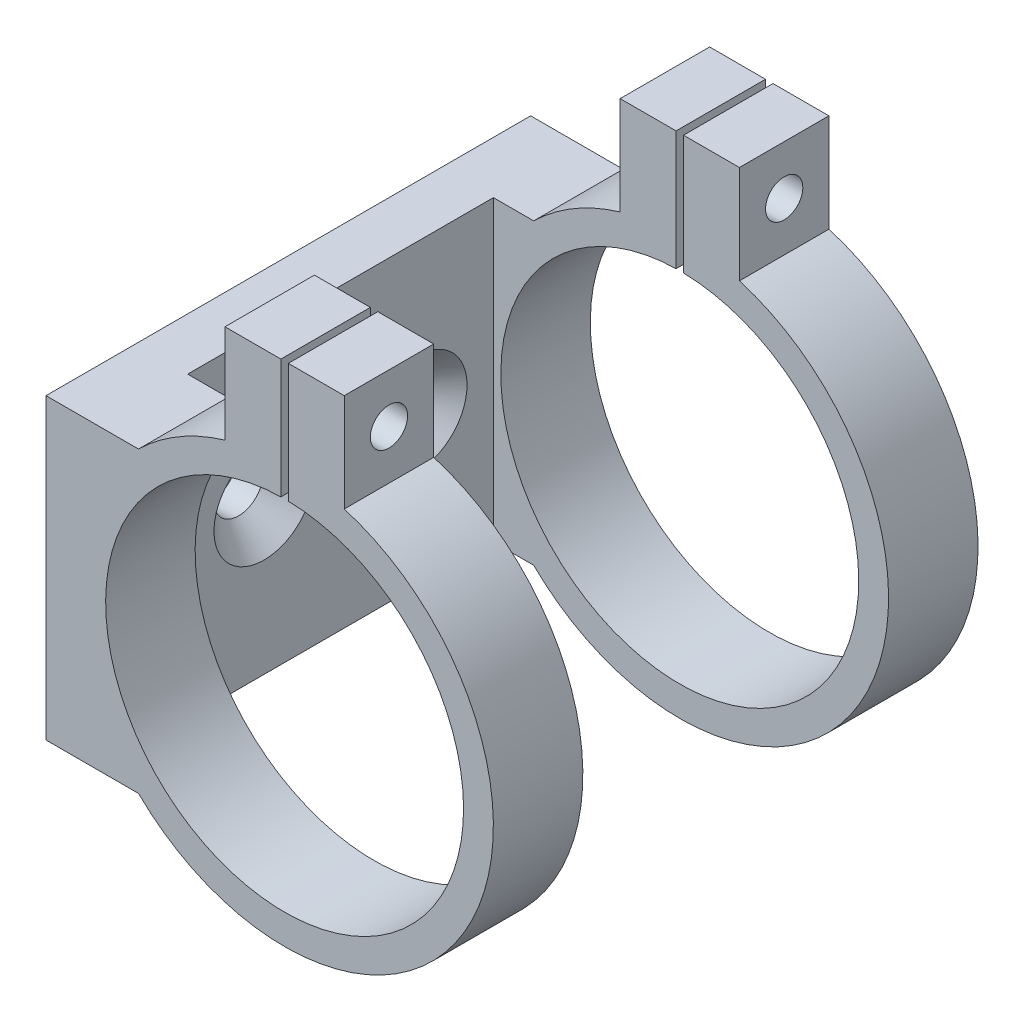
ISO-10303-21;
HEADER;
FILE_DESCRIPTION(('STEP AP214'),'2;1');
FILE_NAME('part.step','',(''),(''),'','','');
FILE_SCHEMA(('AUTOMOTIVE_DESIGN { 1 0 10303 214 1 1 1 1 }'));
ENDSEC;
DATA;
#1=APPLICATION_CONTEXT('core data for automotive mechanical design processes');
#2=APPLICATION_PROTOCOL_DEFINITION('international standard','automotive_design',2000,#1);
#3=PRODUCT_CONTEXT('',#1,'mechanical');
#4=PRODUCT('Part','Part','',(#3));
#5=PRODUCT_RELATED_PRODUCT_CATEGORY('part','',(#4));
#6=PRODUCT_DEFINITION_FORMATION('','',#4);
#7=PRODUCT_DEFINITION_CONTEXT('part definition',#1,'design');
#8=PRODUCT_DEFINITION('design','',#6,#7);
#9=PRODUCT_DEFINITION_SHAPE('','',#8);
#10=(LENGTH_UNIT() NAMED_UNIT(*) SI_UNIT(.MILLI.,.METRE.));
#11=(NAMED_UNIT(*) PLANE_ANGLE_UNIT() SI_UNIT($,.RADIAN.));
#12=(NAMED_UNIT(*) SI_UNIT($,.STERADIAN.) SOLID_ANGLE_UNIT());
#13=UNCERTAINTY_MEASURE_WITH_UNIT(LENGTH_MEASURE(1.E-05),#10,'distance_accuracy_value','');
#14=(GEOMETRIC_REPRESENTATION_CONTEXT(3) GLOBAL_UNCERTAINTY_ASSIGNED_CONTEXT((#13)) GLOBAL_UNIT_ASSIGNED_CONTEXT((#10,
#11,#12)) REPRESENTATION_CONTEXT('',''));
#15=CARTESIAN_POINT('',(0.,0.,0.));
#16=DIRECTION('',(0.,0.,1.));
#17=DIRECTION('',(1.,0.,0.));
#18=AXIS2_PLACEMENT_3D('',#15,#16,#17);
#19=CARTESIAN_POINT('',(0.,40.,32.5));
#20=DIRECTION('',(0.,-1.,0.));
#21=DIRECTION('',(0.,0.,-1.));
#22=AXIS2_PLACEMENT_3D('',#19,#20,#21);
#23=PLANE('',#22);
#24=DIRECTION('',(-1.,0.,0.));
#25=VECTOR('',#24,1.);
#26=CARTESIAN_POINT('',(28.,40.,20.5));
#27=LINE('',#26,#25);
#28=CARTESIAN_POINT('',(8.,40.,20.5));
#29=VERTEX_POINT('',#28);
#30=CARTESIAN_POINT('',(0.5,40.,20.5));
#31=VERTEX_POINT('',#30);
#32=EDGE_CURVE('E295',#29,#31,#27,.T.);
#33=ORIENTED_EDGE('',*,*,#32,.T.);
#34=DIRECTION('',(0.,0.,1.));
#35=VECTOR('',#34,1.);
#36=CARTESIAN_POINT('',(0.500000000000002,40.,32.5));
#37=LINE('',#36,#35);
#38=CARTESIAN_POINT('',(0.500000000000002,40.,32.5));
#39=VERTEX_POINT('',#38);
#40=EDGE_CURVE('E65',#31,#39,#37,.T.);
#41=ORIENTED_EDGE('',*,*,#40,.T.);
#42=DIRECTION('',(-1.,0.,0.));
#43=VECTOR('',#42,1.);
#44=CARTESIAN_POINT('',(0.,40.,32.5));
#45=LINE('',#44,#43);
#46=CARTESIAN_POINT('',(8.,40.,32.5));
#47=VERTEX_POINT('',#46);
#48=EDGE_CURVE('E455',#47,#39,#45,.T.);
#49=ORIENTED_EDGE('',*,*,#48,.F.);
#50=DIRECTION('',(0.,0.,-1.));
#51=VECTOR('',#50,1.);
#52=CARTESIAN_POINT('',(8.,40.,32.5));
#53=LINE('',#52,#51);
#54=EDGE_CURVE('E260',#47,#29,#53,.T.);
#55=ORIENTED_EDGE('',*,*,#54,.T.);
#56=EDGE_LOOP('',(#33,#41,#49,#55));
#57=FACE_BOUND('',#56,.T.);
#58=ADVANCED_FACE('F47',(#57),#23,.F.);
#59=DIRECTION('',(-1.,0.,0.));
#60=VECTOR('',#59,1.);
#61=CARTESIAN_POINT('',(0.,40.,-32.5));
#62=LINE('',#61,#60);
#63=CARTESIAN_POINT('',(8.,40.,-32.5));
#64=VERTEX_POINT('',#63);
#65=CARTESIAN_POINT('',(0.500000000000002,40.,-32.5));
#66=VERTEX_POINT('',#65);
#67=EDGE_CURVE('E240',#64,#66,#62,.T.);
#68=ORIENTED_EDGE('',*,*,#67,.T.);
#69=DIRECTION('',(0.,0.,1.));
#70=VECTOR('',#69,1.);
#71=CARTESIAN_POINT('',(0.500000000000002,40.,32.5));
#72=LINE('',#71,#70);
#73=CARTESIAN_POINT('',(0.5,40.,-20.5));
#74=VERTEX_POINT('',#73);
#75=EDGE_CURVE('E364',#66,#74,#72,.T.);
#76=ORIENTED_EDGE('',*,*,#75,.T.);
#77=DIRECTION('',(-1.,0.,0.));
#78=VECTOR('',#77,1.);
#79=CARTESIAN_POINT('',(28.,40.,-20.5));
#80=LINE('',#79,#78);
#81=CARTESIAN_POINT('',(8.,40.,-20.5));
#82=VERTEX_POINT('',#81);
#83=EDGE_CURVE('E388',#82,#74,#80,.T.);
#84=ORIENTED_EDGE('',*,*,#83,.F.);
#85=EDGE_CURVE('E258',#82,#64,#53,.T.);
#86=ORIENTED_EDGE('',*,*,#85,.T.);
#87=EDGE_LOOP('',(#68,#76,#84,#86));
#88=FACE_BOUND('',#87,.T.);
#89=ADVANCED_FACE('F700',(#88),#23,.F.);
#90=CARTESIAN_POINT('',(-8.,0.,32.5));
#91=DIRECTION('',(1.,0.,0.));
#92=DIRECTION('',(0.,0.,-1.));
#93=AXIS2_PLACEMENT_3D('',#90,#91,#92);
#94=PLANE('',#93);
#95=CARTESIAN_POINT('',(-8.,33.4164078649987,26.5));
#96=DIRECTION('',(1.,0.,0.));
#97=DIRECTION('',(0.,0.,-1.));
#98=AXIS2_PLACEMENT_3D('',#95,#96,#97);
#99=CIRCLE('',#98,2.5);
#100=CARTESIAN_POINT('',(-8.,33.4164078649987,24.));
#101=VERTEX_POINT('',#100);
#102=EDGE_CURVE('E328',#101,#101,#99,.F.);
#103=ORIENTED_EDGE('',*,*,#102,.F.);
#104=EDGE_LOOP('',(#103));
#105=FACE_BOUND('',#104,.T.);
#106=DIRECTION('',(0.,0.,-1.));
#107=VECTOR('',#106,1.);
#108=CARTESIAN_POINT('',(-8.,40.,32.5));
#109=LINE('',#108,#107);
#110=CARTESIAN_POINT('',(-8.,40.,32.5));
#111=VERTEX_POINT('',#110);
#112=CARTESIAN_POINT('',(-8.,40.,20.5));
#113=VERTEX_POINT('',#112);
#114=EDGE_CURVE('E254',#111,#113,#109,.T.);
#115=ORIENTED_EDGE('',*,*,#114,.T.);
#116=DIRECTION('',(0.,-1.,0.));
#117=VECTOR('',#116,1.);
#118=CARTESIAN_POINT('',(-8.,0.,20.5));
#119=LINE('',#118,#117);
#120=CARTESIAN_POINT('',(-8.,26.8328157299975,20.5));
#121=VERTEX_POINT('',#120);
#122=EDGE_CURVE('E428',#113,#121,#119,.T.);
#123=ORIENTED_EDGE('',*,*,#122,.T.);
#124=DIRECTION('',(0.,0.,-1.));
#125=VECTOR('',#124,1.);
#126=CARTESIAN_POINT('',(-8.,26.8328157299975,32.5));
#127=LINE('',#126,#125);
#128=CARTESIAN_POINT('',(-8.,26.8328157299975,32.5));
#129=VERTEX_POINT('',#128);
#130=EDGE_CURVE('E286',#129,#121,#127,.T.);
#131=ORIENTED_EDGE('',*,*,#130,.F.);
#132=DIRECTION('',(0.,-1.,0.));
#133=VECTOR('',#132,1.);
#134=CARTESIAN_POINT('',(-8.,0.,32.5));
#135=LINE('',#134,#133);
#136=EDGE_CURVE('E239',#111,#129,#135,.T.);
#137=ORIENTED_EDGE('',*,*,#136,.F.);
#138=EDGE_LOOP('',(#115,#123,#131,#137));
#139=FACE_BOUND('',#138,.T.);
#140=ADVANCED_FACE('F646',(#105,#139),#94,.F.);
#141=CARTESIAN_POINT('',(0.,0.,32.5));
#142=DIRECTION('',(0.,0.,-1.));
#143=DIRECTION('',(-1.,0.,0.));
#144=AXIS2_PLACEMENT_3D('',#141,#142,#143);
#145=CYLINDRICAL_SURFACE('',#144,28.);
#146=ORIENTED_EDGE('',*,*,#130,.T.);
#147=CARTESIAN_POINT('',(0.,0.,20.5));
#148=DIRECTION('',(0.,0.,1.));
#149=DIRECTION('',(0.,-1.,0.));
#150=AXIS2_PLACEMENT_3D('',#147,#148,#149);
#151=CIRCLE('',#150,28.);
#152=CARTESIAN_POINT('',(-19.5959179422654,20.,20.5));
#153=VERTEX_POINT('',#152);
#154=EDGE_CURVE('E424',#121,#153,#151,.T.);
#155=ORIENTED_EDGE('',*,*,#154,.T.);
#156=DIRECTION('',(0.,0.,-1.));
#157=VECTOR('',#156,1.);
#158=CARTESIAN_POINT('',(-19.5959179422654,20.,32.5));
#159=LINE('',#158,#157);
#160=CARTESIAN_POINT('',(-19.5959179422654,20.,32.5));
#161=VERTEX_POINT('',#160);
#162=EDGE_CURVE('E281',#161,#153,#159,.T.);
#163=ORIENTED_EDGE('',*,*,#162,.F.);
#164=CARTESIAN_POINT('',(0.,0.,32.5));
#165=DIRECTION('',(0.,0.,1.));
#166=DIRECTION('',(1.,0.,0.));
#167=AXIS2_PLACEMENT_3D('',#164,#165,#166);
#168=CIRCLE('',#167,28.);
#169=EDGE_CURVE('E247',#129,#161,#168,.T.);
#170=ORIENTED_EDGE('',*,*,#169,.F.);
#171=EDGE_LOOP('',(#146,#155,#163,#170));
#172=FACE_BOUND('',#171,.T.);
#173=ADVANCED_FACE('F641',(#172),#145,.T.);
#174=CARTESIAN_POINT('',(0.,0.,20.5));
#175=DIRECTION('',(0.,0.,1.));
#176=DIRECTION('',(0.,-1.,0.));
#177=AXIS2_PLACEMENT_3D('',#174,#175,#176);
#178=CIRCLE('',#177,28.);
#179=CARTESIAN_POINT('',(-19.5959179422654,-20.,20.5));
#180=VERTEX_POINT('',#179);
#181=CARTESIAN_POINT('',(8.,26.8328157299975,20.5));
#182=VERTEX_POINT('',#181);
#183=EDGE_CURVE('E414',#180,#182,#178,.T.);
#184=ORIENTED_EDGE('',*,*,#183,.T.);
#185=DIRECTION('',(0.,0.,-1.));
#186=VECTOR('',#185,1.);
#187=CARTESIAN_POINT('',(8.,26.8328157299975,32.5));
#188=LINE('',#187,#186);
#189=CARTESIAN_POINT('',(8.,26.8328157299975,32.5));
#190=VERTEX_POINT('',#189);
#191=EDGE_CURVE('E265',#190,#182,#188,.T.);
#192=ORIENTED_EDGE('',*,*,#191,.F.);
#193=CARTESIAN_POINT('',(-19.5959179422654,-20.,32.5));
#194=VERTEX_POINT('',#193);
#195=EDGE_CURVE('E439',#194,#190,#168,.T.);
#196=ORIENTED_EDGE('',*,*,#195,.F.);
#197=DIRECTION('',(0.,0.,-1.));
#198=VECTOR('',#197,1.);
#199=CARTESIAN_POINT('',(-19.5959179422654,-20.,32.5));
#200=LINE('',#199,#198);
#201=EDGE_CURVE('E270',#194,#180,#200,.T.);
#202=ORIENTED_EDGE('',*,*,#201,.T.);
#203=EDGE_LOOP('',(#184,#192,#196,#202));
#204=FACE_BOUND('',#203,.T.);
#205=ADVANCED_FACE('F671',(#204),#145,.T.);
#206=CARTESIAN_POINT('',(8.,0.,32.5));
#207=DIRECTION('',(1.,0.,0.));
#208=DIRECTION('',(0.,0.,-1.));
#209=AXIS2_PLACEMENT_3D('',#206,#207,#208);
#210=PLANE('',#209);
#211=CARTESIAN_POINT('',(8.,33.4164078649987,26.5));
#212=DIRECTION('',(1.,0.,0.));
#213=DIRECTION('',(0.,0.,-1.));
#214=AXIS2_PLACEMENT_3D('',#211,#212,#213);
#215=CIRCLE('',#214,2.5);
#216=CARTESIAN_POINT('',(8.,33.4164078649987,24.));
#217=VERTEX_POINT('',#216);
#218=EDGE_CURVE('E332',#217,#217,#215,.T.);
#219=ORIENTED_EDGE('',*,*,#218,.F.);
#220=EDGE_LOOP('',(#219));
#221=FACE_BOUND('',#220,.T.);
#222=DIRECTION('',(0.,-1.,0.));
#223=VECTOR('',#222,1.);
#224=CARTESIAN_POINT('',(8.,0.,20.5));
#225=LINE('',#224,#223);
#226=EDGE_CURVE('E300',#29,#182,#225,.T.);
#227=ORIENTED_EDGE('',*,*,#226,.F.);
#228=ORIENTED_EDGE('',*,*,#54,.F.);
#229=DIRECTION('',(0.,-1.,0.));
#230=VECTOR('',#229,1.);
#231=CARTESIAN_POINT('',(8.,0.,32.5));
#232=LINE('',#231,#230);
#233=EDGE_CURVE('E450',#47,#190,#232,.T.);
#234=ORIENTED_EDGE('',*,*,#233,.T.);
#235=ORIENTED_EDGE('',*,*,#191,.T.);
#236=EDGE_LOOP('',(#227,#228,#234,#235));
#237=FACE_BOUND('',#236,.T.);
#238=ADVANCED_FACE('F667',(#221,#237),#210,.T.);
#239=CARTESIAN_POINT('',(-0.499999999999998,40.,32.5));
#240=VERTEX_POINT('',#239);
#241=EDGE_CURVE('E454',#240,#111,#45,.T.);
#242=ORIENTED_EDGE('',*,*,#241,.F.);
#243=DIRECTION('',(0.,0.,-1.));
#244=VECTOR('',#243,1.);
#245=CARTESIAN_POINT('',(-0.499999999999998,40.,32.5));
#246=LINE('',#245,#244);
#247=CARTESIAN_POINT('',(-0.499999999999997,40.,20.5));
#248=VERTEX_POINT('',#247);
#249=EDGE_CURVE('E358',#240,#248,#246,.T.);
#250=ORIENTED_EDGE('',*,*,#249,.T.);
#251=EDGE_CURVE('E387',#248,#113,#27,.T.);
#252=ORIENTED_EDGE('',*,*,#251,.T.);
#253=ORIENTED_EDGE('',*,*,#114,.F.);
#254=EDGE_LOOP('',(#242,#250,#252,#253));
#255=FACE_BOUND('',#254,.T.);
#256=ADVANCED_FACE('F651',(#255),#23,.F.);
#257=CARTESIAN_POINT('',(0.,0.,32.5));
#258=DIRECTION('',(0.,0.,-1.));
#259=DIRECTION('',(-1.,0.,0.));
#260=AXIS2_PLACEMENT_3D('',#257,#258,#259);
#261=CYLINDRICAL_SURFACE('',#260,24.);
#262=DIRECTION('',(0.,0.,-1.));
#263=VECTOR('',#262,1.);
#264=CARTESIAN_POINT('',(0.500000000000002,23.9947911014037,32.5));
#265=LINE('',#264,#263);
#266=CARTESIAN_POINT('',(0.5,23.9947911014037,20.5));
#267=VERTEX_POINT('',#266);
#268=CARTESIAN_POINT('',(0.500000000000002,23.9947911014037,32.5));
#269=VERTEX_POINT('',#268);
#270=EDGE_CURVE('E371',#267,#269,#265,.F.);
#271=ORIENTED_EDGE('',*,*,#270,.F.);
#272=CARTESIAN_POINT('',(0.,0.,20.5));
#273=DIRECTION('',(0.,0.,1.));
#274=DIRECTION('',(0.,-1.,0.));
#275=AXIS2_PLACEMENT_3D('',#272,#273,#274);
#276=CIRCLE('',#275,24.);
#277=CARTESIAN_POINT('',(-0.499999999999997,23.9947911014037,20.5));
#278=VERTEX_POINT('',#277);
#279=EDGE_CURVE('E296',#278,#267,#276,.T.);
#280=ORIENTED_EDGE('',*,*,#279,.F.);
#281=DIRECTION('',(0.,0.,-1.));
#282=VECTOR('',#281,1.);
#283=CARTESIAN_POINT('',(-0.499999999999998,23.9947911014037,32.5));
#284=LINE('',#283,#282);
#285=CARTESIAN_POINT('',(-0.499999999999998,23.9947911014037,32.5));
#286=VERTEX_POINT('',#285);
#287=EDGE_CURVE('E73',#286,#278,#284,.T.);
#288=ORIENTED_EDGE('',*,*,#287,.F.);
#289=CARTESIAN_POINT('',(0.,0.,32.5));
#290=DIRECTION('',(0.,0.,1.));
#291=DIRECTION('',(1.,0.,0.));
#292=AXIS2_PLACEMENT_3D('',#289,#290,#291);
#293=CIRCLE('',#292,24.);
#294=EDGE_CURVE('E459',#286,#269,#293,.T.);
#295=ORIENTED_EDGE('',*,*,#294,.T.);
#296=EDGE_LOOP('',(#271,#280,#288,#295));
#297=FACE_BOUND('',#296,.T.);
#298=ADVANCED_FACE('F655',(#297),#261,.F.);
#299=CARTESIAN_POINT('',(-8.,33.4164078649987,-26.5));
#300=DIRECTION('',(1.,0.,0.));
#301=DIRECTION('',(0.,0.,-1.));
#302=AXIS2_PLACEMENT_3D('',#299,#300,#301);
#303=CIRCLE('',#302,2.5);
#304=CARTESIAN_POINT('',(-8.,33.4164078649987,-29.));
#305=VERTEX_POINT('',#304);
#306=EDGE_CURVE('E310',#305,#305,#303,.F.);
#307=ORIENTED_EDGE('',*,*,#306,.F.);
#308=EDGE_LOOP('',(#307));
#309=FACE_BOUND('',#308,.T.);
#310=CARTESIAN_POINT('',(-8.,26.8328157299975,-20.5));
#311=VERTEX_POINT('',#310);
#312=CARTESIAN_POINT('',(-8.,26.8328157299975,-32.5));
#313=VERTEX_POINT('',#312);
#314=EDGE_CURVE('E285',#311,#313,#127,.T.);
#315=ORIENTED_EDGE('',*,*,#314,.F.);
#316=DIRECTION('',(0.,1.,0.));
#317=VECTOR('',#316,1.);
#318=CARTESIAN_POINT('',(-8.,0.,-20.5));
#319=LINE('',#318,#317);
#320=CARTESIAN_POINT('',(-8.,40.,-20.5));
#321=VERTEX_POINT('',#320);
#322=EDGE_CURVE('E301',#311,#321,#319,.T.);
#323=ORIENTED_EDGE('',*,*,#322,.T.);
#324=CARTESIAN_POINT('',(-8.,40.,-32.5));
#325=VERTEX_POINT('',#324);
#326=EDGE_CURVE('E259',#321,#325,#109,.T.);
#327=ORIENTED_EDGE('',*,*,#326,.T.);
#328=DIRECTION('',(0.,-1.,0.));
#329=VECTOR('',#328,1.);
#330=CARTESIAN_POINT('',(-8.,0.,-32.5));
#331=LINE('',#330,#329);
#332=EDGE_CURVE('E434',#325,#313,#331,.T.);
#333=ORIENTED_EDGE('',*,*,#332,.T.);
#334=EDGE_LOOP('',(#315,#323,#327,#333));
#335=FACE_BOUND('',#334,.T.);
#336=ADVANCED_FACE('F49',(#309,#335),#94,.F.);
#337=CARTESIAN_POINT('',(-19.5959179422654,20.,-20.5));
#338=VERTEX_POINT('',#337);
#339=CARTESIAN_POINT('',(-19.5959179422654,20.,-32.5));
#340=VERTEX_POINT('',#339);
#341=EDGE_CURVE('E280',#338,#340,#159,.T.);
#342=ORIENTED_EDGE('',*,*,#341,.F.);
#343=CARTESIAN_POINT('',(0.,0.,-20.5));
#344=DIRECTION('',(0.,0.,-1.));
#345=DIRECTION('',(-1.,0.,0.));
#346=AXIS2_PLACEMENT_3D('',#343,#344,#345);
#347=CIRCLE('',#346,28.);
#348=EDGE_CURVE('E404',#338,#311,#347,.T.);
#349=ORIENTED_EDGE('',*,*,#348,.T.);
#350=ORIENTED_EDGE('',*,*,#314,.T.);
#351=CARTESIAN_POINT('',(0.,0.,-32.5));
#352=DIRECTION('',(0.,0.,1.));
#353=DIRECTION('',(1.,0.,0.));
#354=AXIS2_PLACEMENT_3D('',#351,#352,#353);
#355=CIRCLE('',#354,28.);
#356=EDGE_CURVE('E466',#313,#340,#355,.T.);
#357=ORIENTED_EDGE('',*,*,#356,.T.);
#358=EDGE_LOOP('',(#342,#349,#350,#357));
#359=FACE_BOUND('',#358,.T.);
#360=ADVANCED_FACE('F677',(#359),#145,.T.);
#361=CARTESIAN_POINT('',(0.,20.,32.5));
#362=DIRECTION('',(0.,1.,0.));
#363=DIRECTION('',(0.,0.,1.));
#364=AXIS2_PLACEMENT_3D('',#361,#362,#363);
#365=PLANE('',#364);
#366=DIRECTION('',(1.,0.,0.));
#367=VECTOR('',#366,1.);
#368=CARTESIAN_POINT('',(0.,20.,20.5));
#369=LINE('',#368,#367);
#370=CARTESIAN_POINT('',(-25.,20.,20.5));
#371=VERTEX_POINT('',#370);
#372=EDGE_CURVE('E421',#371,#153,#369,.T.);
#373=ORIENTED_EDGE('',*,*,#372,.F.);
#374=DIRECTION('',(0.,0.,1.));
#375=VECTOR('',#374,1.);
#376=CARTESIAN_POINT('',(-25.,20.,32.5));
#377=LINE('',#376,#375);
#378=CARTESIAN_POINT('',(-25.,20.,-20.5));
#379=VERTEX_POINT('',#378);
#380=EDGE_CURVE('E432',#379,#371,#377,.T.);
#381=ORIENTED_EDGE('',*,*,#380,.F.);
#382=DIRECTION('',(-1.,0.,0.));
#383=VECTOR('',#382,1.);
#384=CARTESIAN_POINT('',(0.,20.,-20.5));
#385=LINE('',#384,#383);
#386=EDGE_CURVE('E401',#338,#379,#385,.T.);
#387=ORIENTED_EDGE('',*,*,#386,.F.);
#388=ORIENTED_EDGE('',*,*,#341,.T.);
#389=DIRECTION('',(1.,0.,0.));
#390=VECTOR('',#389,1.);
#391=CARTESIAN_POINT('',(0.,20.,-32.5));
#392=LINE('',#391,#390);
#393=CARTESIAN_POINT('',(-32.,20.,-32.5));
#394=VERTEX_POINT('',#393);
#395=EDGE_CURVE('E470',#394,#340,#392,.T.);
#396=ORIENTED_EDGE('',*,*,#395,.F.);
#397=DIRECTION('',(0.,0.,-1.));
#398=VECTOR('',#397,1.);
#399=CARTESIAN_POINT('',(-32.,20.,32.5));
#400=LINE('',#399,#398);
#401=CARTESIAN_POINT('',(-32.,20.,32.5));
#402=VERTEX_POINT('',#401);
#403=EDGE_CURVE('E277',#402,#394,#400,.T.);
#404=ORIENTED_EDGE('',*,*,#403,.F.);
#405=DIRECTION('',(1.,0.,0.));
#406=VECTOR('',#405,1.);
#407=CARTESIAN_POINT('',(0.,20.,32.5));
#408=LINE('',#407,#406);
#409=EDGE_CURVE('E438',#402,#161,#408,.T.);
#410=ORIENTED_EDGE('',*,*,#409,.T.);
#411=ORIENTED_EDGE('',*,*,#162,.T.);
#412=EDGE_LOOP('',(#373,#381,#387,#388,#396,#404,#410,#411));
#413=FACE_BOUND('',#412,.T.);
#414=ADVANCED_FACE('F507',(#413),#365,.T.);
#415=CARTESIAN_POINT('',(-32.,0.,32.5));
#416=DIRECTION('',(-1.,0.,0.));
#417=DIRECTION('',(0.,-1.,0.));
#418=AXIS2_PLACEMENT_3D('',#415,#416,#417);
#419=PLANE('',#418);
#420=CARTESIAN_POINT('',(-32.,0.,10.25));
#421=DIRECTION('',(1.,0.,0.));
#422=DIRECTION('',(0.,0.,-1.));
#423=AXIS2_PLACEMENT_3D('',#420,#421,#422);
#424=CIRCLE('',#423,3.3);
#425=CARTESIAN_POINT('',(-32.,0.,6.95));
#426=VERTEX_POINT('',#425);
#427=EDGE_CURVE('E618',#426,#426,#424,.T.);
#428=ORIENTED_EDGE('',*,*,#427,.T.);
#429=EDGE_LOOP('',(#428));
#430=FACE_BOUND('',#429,.T.);
#431=CARTESIAN_POINT('',(-32.,0.,-10.25));
#432=DIRECTION('',(1.,0.,0.));
#433=DIRECTION('',(0.,0.,-1.));
#434=AXIS2_PLACEMENT_3D('',#431,#432,#433);
#435=CIRCLE('',#434,3.3);
#436=CARTESIAN_POINT('',(-32.,0.,-13.55));
#437=VERTEX_POINT('',#436);
#438=EDGE_CURVE('E336',#437,#437,#435,.T.);
#439=ORIENTED_EDGE('',*,*,#438,.T.);
#440=EDGE_LOOP('',(#439));
#441=FACE_BOUND('',#440,.T.);
#442=DIRECTION('',(0.,1.,0.));
#443=VECTOR('',#442,1.);
#444=CARTESIAN_POINT('',(-32.,0.,-32.5));
#445=LINE('',#444,#443);
#446=CARTESIAN_POINT('',(-32.,-20.,-32.5));
#447=VERTEX_POINT('',#446);
#448=EDGE_CURVE('E475',#447,#394,#445,.T.);
#449=ORIENTED_EDGE('',*,*,#448,.F.);
#450=DIRECTION('',(0.,0.,-1.));
#451=VECTOR('',#450,1.);
#452=CARTESIAN_POINT('',(-32.,-20.,32.5));
#453=LINE('',#452,#451);
#454=CARTESIAN_POINT('',(-32.,-20.,32.5));
#455=VERTEX_POINT('',#454);
#456=EDGE_CURVE('E274',#455,#447,#453,.T.);
#457=ORIENTED_EDGE('',*,*,#456,.F.);
#458=DIRECTION('',(0.,1.,0.));
#459=VECTOR('',#458,1.);
#460=CARTESIAN_POINT('',(-32.,0.,32.5));
#461=LINE('',#460,#459);
#462=EDGE_CURVE('E443',#455,#402,#461,.T.);
#463=ORIENTED_EDGE('',*,*,#462,.T.);
#464=ORIENTED_EDGE('',*,*,#403,.T.);
#465=EDGE_LOOP('',(#449,#457,#463,#464));
#466=FACE_BOUND('',#465,.T.);
#467=ADVANCED_FACE('F500',(#430,#441,#466),#419,.T.);
#468=CARTESIAN_POINT('',(0.,-20.,32.5));
#469=DIRECTION('',(0.,1.,0.));
#470=DIRECTION('',(0.,0.,1.));
#471=AXIS2_PLACEMENT_3D('',#468,#469,#470);
#472=PLANE('',#471);
#473=DIRECTION('',(0.,0.,1.));
#474=VECTOR('',#473,1.);
#475=CARTESIAN_POINT('',(-25.,-20.,32.5));
#476=LINE('',#475,#474);
#477=CARTESIAN_POINT('',(-25.,-20.,-20.5));
#478=VERTEX_POINT('',#477);
#479=CARTESIAN_POINT('',(-25.,-20.,20.5));
#480=VERTEX_POINT('',#479);
#481=EDGE_CURVE('E290',#478,#480,#476,.T.);
#482=ORIENTED_EDGE('',*,*,#481,.T.);
#483=DIRECTION('',(1.,0.,0.));
#484=VECTOR('',#483,1.);
#485=CARTESIAN_POINT('',(0.,-20.,20.5));
#486=LINE('',#485,#484);
#487=EDGE_CURVE('E417',#480,#180,#486,.T.);
#488=ORIENTED_EDGE('',*,*,#487,.T.);
#489=ORIENTED_EDGE('',*,*,#201,.F.);
#490=DIRECTION('',(1.,0.,0.));
#491=VECTOR('',#490,1.);
#492=CARTESIAN_POINT('',(0.,-20.,32.5));
#493=LINE('',#492,#491);
#494=EDGE_CURVE('E447',#455,#194,#493,.T.);
#495=ORIENTED_EDGE('',*,*,#494,.F.);
#496=ORIENTED_EDGE('',*,*,#456,.T.);
#497=DIRECTION('',(1.,0.,0.));
#498=VECTOR('',#497,1.);
#499=CARTESIAN_POINT('',(0.,-20.,-32.5));
#500=LINE('',#499,#498);
#501=CARTESIAN_POINT('',(-19.5959179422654,-20.,-32.5));
#502=VERTEX_POINT('',#501);
#503=EDGE_CURVE('E478',#447,#502,#500,.T.);
#504=ORIENTED_EDGE('',*,*,#503,.T.);
#505=CARTESIAN_POINT('',(-19.5959179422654,-20.,-20.5));
#506=VERTEX_POINT('',#505);
#507=EDGE_CURVE('E269',#506,#502,#200,.T.);
#508=ORIENTED_EDGE('',*,*,#507,.F.);
#509=DIRECTION('',(-1.,0.,0.));
#510=VECTOR('',#509,1.);
#511=CARTESIAN_POINT('',(0.,-20.,-20.5));
#512=LINE('',#511,#510);
#513=EDGE_CURVE('E397',#506,#478,#512,.T.);
#514=ORIENTED_EDGE('',*,*,#513,.T.);
#515=EDGE_LOOP('',(#482,#488,#489,#495,#496,#504,#508,#514));
#516=FACE_BOUND('',#515,.T.);
#517=ADVANCED_FACE('F673',(#516),#472,.F.);
#518=CARTESIAN_POINT('',(8.,26.8328157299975,-20.5));
#519=VERTEX_POINT('',#518);
#520=CARTESIAN_POINT('',(8.,26.8328157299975,-32.5));
#521=VERTEX_POINT('',#520);
#522=EDGE_CURVE('E264',#519,#521,#188,.T.);
#523=ORIENTED_EDGE('',*,*,#522,.F.);
#524=CARTESIAN_POINT('',(0.,0.,-20.5));
#525=DIRECTION('',(0.,0.,-1.));
#526=DIRECTION('',(-1.,0.,0.));
#527=AXIS2_PLACEMENT_3D('',#524,#525,#526);
#528=CIRCLE('',#527,28.);
#529=EDGE_CURVE('E394',#519,#506,#528,.T.);
#530=ORIENTED_EDGE('',*,*,#529,.T.);
#531=ORIENTED_EDGE('',*,*,#507,.T.);
#532=EDGE_CURVE('E471',#502,#521,#355,.T.);
#533=ORIENTED_EDGE('',*,*,#532,.T.);
#534=EDGE_LOOP('',(#523,#530,#531,#533));
#535=FACE_BOUND('',#534,.T.);
#536=ADVANCED_FACE('F494',(#535),#145,.T.);
#537=CARTESIAN_POINT('',(8.,33.4164078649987,-26.5));
#538=DIRECTION('',(1.,0.,0.));
#539=DIRECTION('',(0.,0.,-1.));
#540=AXIS2_PLACEMENT_3D('',#537,#538,#539);
#541=CIRCLE('',#540,2.5);
#542=CARTESIAN_POINT('',(8.,33.4164078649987,-29.));
#543=VERTEX_POINT('',#542);
#544=EDGE_CURVE('E321',#543,#543,#541,.T.);
#545=ORIENTED_EDGE('',*,*,#544,.F.);
#546=EDGE_LOOP('',(#545));
#547=FACE_BOUND('',#546,.T.);
#548=DIRECTION('',(0.,1.,0.));
#549=VECTOR('',#548,1.);
#550=CARTESIAN_POINT('',(8.,0.,-20.5));
#551=LINE('',#550,#549);
#552=EDGE_CURVE('E294',#519,#82,#551,.T.);
#553=ORIENTED_EDGE('',*,*,#552,.F.);
#554=ORIENTED_EDGE('',*,*,#522,.T.);
#555=DIRECTION('',(0.,-1.,0.));
#556=VECTOR('',#555,1.);
#557=CARTESIAN_POINT('',(8.,0.,-32.5));
#558=LINE('',#557,#556);
#559=EDGE_CURVE('E481',#64,#521,#558,.T.);
#560=ORIENTED_EDGE('',*,*,#559,.F.);
#561=ORIENTED_EDGE('',*,*,#85,.F.);
#562=EDGE_LOOP('',(#553,#554,#560,#561));
#563=FACE_BOUND('',#562,.T.);
#564=ADVANCED_FACE('F710',(#547,#563),#210,.T.);
#565=CARTESIAN_POINT('',(-0.499999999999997,40.,-20.5));
#566=VERTEX_POINT('',#565);
#567=EDGE_CURVE('E383',#566,#321,#80,.T.);
#568=ORIENTED_EDGE('',*,*,#567,.F.);
#569=DIRECTION('',(0.,0.,-1.));
#570=VECTOR('',#569,1.);
#571=CARTESIAN_POINT('',(-0.499999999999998,40.,32.5));
#572=LINE('',#571,#570);
#573=CARTESIAN_POINT('',(-0.499999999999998,40.,-32.5));
#574=VERTEX_POINT('',#573);
#575=EDGE_CURVE('E221',#566,#574,#572,.T.);
#576=ORIENTED_EDGE('',*,*,#575,.T.);
#577=EDGE_CURVE('E231',#574,#325,#62,.T.);
#578=ORIENTED_EDGE('',*,*,#577,.T.);
#579=ORIENTED_EDGE('',*,*,#326,.F.);
#580=EDGE_LOOP('',(#568,#576,#578,#579));
#581=FACE_BOUND('',#580,.T.);
#582=ADVANCED_FACE('F702',(#581),#23,.F.);
#583=DIRECTION('',(0.,0.,-1.));
#584=VECTOR('',#583,1.);
#585=CARTESIAN_POINT('',(0.500000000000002,23.9947911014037,32.5));
#586=LINE('',#585,#584);
#587=CARTESIAN_POINT('',(0.500000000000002,23.9947911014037,-32.5));
#588=VERTEX_POINT('',#587);
#589=CARTESIAN_POINT('',(0.5,23.9947911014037,-20.5));
#590=VERTEX_POINT('',#589);
#591=EDGE_CURVE('E237',#588,#590,#586,.F.);
#592=ORIENTED_EDGE('',*,*,#591,.F.);
#593=CARTESIAN_POINT('',(0.,0.,-32.5));
#594=DIRECTION('',(0.,0.,1.));
#595=DIRECTION('',(1.,0.,0.));
#596=AXIS2_PLACEMENT_3D('',#593,#594,#595);
#597=CIRCLE('',#596,24.);
#598=CARTESIAN_POINT('',(-0.499999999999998,23.9947911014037,-32.5));
#599=VERTEX_POINT('',#598);
#600=EDGE_CURVE('E229',#599,#588,#597,.T.);
#601=ORIENTED_EDGE('',*,*,#600,.F.);
#602=DIRECTION('',(0.,0.,-1.));
#603=VECTOR('',#602,1.);
#604=CARTESIAN_POINT('',(-0.499999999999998,23.9947911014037,32.5));
#605=LINE('',#604,#603);
#606=CARTESIAN_POINT('',(-0.499999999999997,23.9947911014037,-20.5));
#607=VERTEX_POINT('',#606);
#608=EDGE_CURVE('E210',#607,#599,#605,.T.);
#609=ORIENTED_EDGE('',*,*,#608,.F.);
#610=CARTESIAN_POINT('',(0.,0.,-20.5));
#611=DIRECTION('',(0.,0.,-1.));
#612=DIRECTION('',(-1.,0.,0.));
#613=AXIS2_PLACEMENT_3D('',#610,#611,#612);
#614=CIRCLE('',#613,24.);
#615=EDGE_CURVE('E291',#590,#607,#614,.T.);
#616=ORIENTED_EDGE('',*,*,#615,.F.);
#617=EDGE_LOOP('',(#592,#601,#609,#616));
#618=FACE_BOUND('',#617,.T.);
#619=ADVANCED_FACE('F236',(#618),#261,.F.);
#620=CARTESIAN_POINT('',(0.,0.,32.5));
#621=DIRECTION('',(0.,0.,1.));
#622=DIRECTION('',(1.,0.,0.));
#623=AXIS2_PLACEMENT_3D('',#620,#621,#622);
#624=PLANE('',#623);
#625=DIRECTION('',(0.,1.,0.));
#626=VECTOR('',#625,1.);
#627=CARTESIAN_POINT('',(0.500000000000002,16.7683220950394,32.5));
#628=LINE('',#627,#626);
#629=EDGE_CURVE('E343',#269,#39,#628,.T.);
#630=ORIENTED_EDGE('',*,*,#629,.F.);
#631=ORIENTED_EDGE('',*,*,#294,.F.);
#632=DIRECTION('',(0.,-1.,0.));
#633=VECTOR('',#632,1.);
#634=CARTESIAN_POINT('',(-0.499999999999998,16.7683220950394,32.5));
#635=LINE('',#634,#633);
#636=EDGE_CURVE('E233',#240,#286,#635,.T.);
#637=ORIENTED_EDGE('',*,*,#636,.F.);
#638=ORIENTED_EDGE('',*,*,#241,.T.);
#639=ORIENTED_EDGE('',*,*,#136,.T.);
#640=ORIENTED_EDGE('',*,*,#169,.T.);
#641=ORIENTED_EDGE('',*,*,#409,.F.);
#642=ORIENTED_EDGE('',*,*,#462,.F.);
#643=ORIENTED_EDGE('',*,*,#494,.T.);
#644=ORIENTED_EDGE('',*,*,#195,.T.);
#645=ORIENTED_EDGE('',*,*,#233,.F.);
#646=ORIENTED_EDGE('',*,*,#48,.T.);
#647=EDGE_LOOP('',(#630,#631,#637,#638,#639,#640,#641,#642,#643,#644,#645,#646));
#648=FACE_BOUND('',#647,.T.);
#649=ADVANCED_FACE('F660',(#648),#624,.T.);
#650=CARTESIAN_POINT('',(0.,0.,-32.5));
#651=DIRECTION('',(0.,0.,1.));
#652=DIRECTION('',(1.,0.,0.));
#653=AXIS2_PLACEMENT_3D('',#650,#651,#652);
#654=PLANE('',#653);
#655=ORIENTED_EDGE('',*,*,#600,.T.);
#656=DIRECTION('',(0.,-1.,0.));
#657=VECTOR('',#656,1.);
#658=CARTESIAN_POINT('',(0.500000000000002,16.7683220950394,-32.5));
#659=LINE('',#658,#657);
#660=EDGE_CURVE('E222',#66,#588,#659,.T.);
#661=ORIENTED_EDGE('',*,*,#660,.F.);
#662=ORIENTED_EDGE('',*,*,#67,.F.);
#663=ORIENTED_EDGE('',*,*,#559,.T.);
#664=ORIENTED_EDGE('',*,*,#532,.F.);
#665=ORIENTED_EDGE('',*,*,#503,.F.);
#666=ORIENTED_EDGE('',*,*,#448,.T.);
#667=ORIENTED_EDGE('',*,*,#395,.T.);
#668=ORIENTED_EDGE('',*,*,#356,.F.);
#669=ORIENTED_EDGE('',*,*,#332,.F.);
#670=ORIENTED_EDGE('',*,*,#577,.F.);
#671=DIRECTION('',(0.,1.,0.));
#672=VECTOR('',#671,1.);
#673=CARTESIAN_POINT('',(-0.499999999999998,16.7683220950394,-32.5));
#674=LINE('',#673,#672);
#675=EDGE_CURVE('E213',#599,#574,#674,.T.);
#676=ORIENTED_EDGE('',*,*,#675,.F.);
#677=EDGE_LOOP('',(#655,#661,#662,#663,#664,#665,#666,#667,#668,#669,#670,#676));
#678=FACE_BOUND('',#677,.T.);
#679=ADVANCED_FACE('F227',(#678),#654,.F.);
#680=CARTESIAN_POINT('',(-25.,0.,0.));
#681=DIRECTION('',(-1.,0.,0.));
#682=DIRECTION('',(0.,-1.,0.));
#683=AXIS2_PLACEMENT_3D('',#680,#681,#682);
#684=PLANE('',#683);
#685=CARTESIAN_POINT('',(-25.,0.,10.25));
#686=DIRECTION('',(1.,0.,0.));
#687=DIRECTION('',(0.,0.,-1.));
#688=AXIS2_PLACEMENT_3D('',#685,#686,#687);
#689=CIRCLE('',#688,6.72);
#690=CARTESIAN_POINT('',(-25.,0.,3.53));
#691=VERTEX_POINT('',#690);
#692=EDGE_CURVE('E609',#691,#691,#689,.T.);
#693=ORIENTED_EDGE('',*,*,#692,.F.);
#694=EDGE_LOOP('',(#693));
#695=FACE_BOUND('',#694,.T.);
#696=CARTESIAN_POINT('',(-25.,0.,-10.25));
#697=DIRECTION('',(1.,0.,0.));
#698=DIRECTION('',(0.,0.,-1.));
#699=AXIS2_PLACEMENT_3D('',#696,#697,#698);
#700=CIRCLE('',#699,6.72);
#701=CARTESIAN_POINT('',(-25.,0.,-16.97));
#702=VERTEX_POINT('',#701);
#703=EDGE_CURVE('E547',#702,#702,#700,.T.);
#704=ORIENTED_EDGE('',*,*,#703,.F.);
#705=EDGE_LOOP('',(#704));
#706=FACE_BOUND('',#705,.T.);
#707=ORIENTED_EDGE('',*,*,#380,.T.);
#708=DIRECTION('',(0.,1.,0.));
#709=VECTOR('',#708,1.);
#710=CARTESIAN_POINT('',(-25.,-28.6785452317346,20.5));
#711=LINE('',#710,#709);
#712=EDGE_CURVE('E379',#480,#371,#711,.T.);
#713=ORIENTED_EDGE('',*,*,#712,.F.);
#714=ORIENTED_EDGE('',*,*,#481,.F.);
#715=DIRECTION('',(0.,-1.,0.));
#716=VECTOR('',#715,1.);
#717=CARTESIAN_POINT('',(-25.,40.,-20.5));
#718=LINE('',#717,#716);
#719=EDGE_CURVE('E376',#379,#478,#718,.T.);
#720=ORIENTED_EDGE('',*,*,#719,.F.);
#721=EDGE_LOOP('',(#707,#713,#714,#720));
#722=FACE_BOUND('',#721,.T.);
#723=ADVANCED_FACE('F629',(#695,#706,#722),#684,.F.);
#724=CARTESIAN_POINT('',(28.,-28.6785452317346,20.5));
#725=DIRECTION('',(0.,0.,1.));
#726=DIRECTION('',(0.,-1.,0.));
#727=AXIS2_PLACEMENT_3D('',#724,#725,#726);
#728=PLANE('',#727);
#729=ORIENTED_EDGE('',*,*,#279,.T.);
#730=DIRECTION('',(0.,1.,0.));
#731=VECTOR('',#730,1.);
#732=CARTESIAN_POINT('',(0.5,-28.6785452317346,20.5));
#733=LINE('',#732,#731);
#734=EDGE_CURVE('E368',#267,#31,#733,.T.);
#735=ORIENTED_EDGE('',*,*,#734,.T.);
#736=ORIENTED_EDGE('',*,*,#32,.F.);
#737=ORIENTED_EDGE('',*,*,#226,.T.);
#738=ORIENTED_EDGE('',*,*,#183,.F.);
#739=ORIENTED_EDGE('',*,*,#487,.F.);
#740=ORIENTED_EDGE('',*,*,#712,.T.);
#741=ORIENTED_EDGE('',*,*,#372,.T.);
#742=ORIENTED_EDGE('',*,*,#154,.F.);
#743=ORIENTED_EDGE('',*,*,#122,.F.);
#744=ORIENTED_EDGE('',*,*,#251,.F.);
#745=DIRECTION('',(0.,-1.,0.));
#746=VECTOR('',#745,1.);
#747=CARTESIAN_POINT('',(-0.499999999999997,-28.6785452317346,20.5));
#748=LINE('',#747,#746);
#749=EDGE_CURVE('E353',#248,#278,#748,.T.);
#750=ORIENTED_EDGE('',*,*,#749,.T.);
#751=EDGE_LOOP('',(#729,#735,#736,#737,#738,#739,#740,#741,#742,#743,#744,#750));
#752=FACE_BOUND('',#751,.T.);
#753=ADVANCED_FACE('F632',(#752),#728,.F.);
#754=CARTESIAN_POINT('',(28.,40.,-20.5));
#755=DIRECTION('',(0.,0.,-1.));
#756=DIRECTION('',(-1.,0.,0.));
#757=AXIS2_PLACEMENT_3D('',#754,#755,#756);
#758=PLANE('',#757);
#759=ORIENTED_EDGE('',*,*,#83,.T.);
#760=DIRECTION('',(0.,-1.,0.));
#761=VECTOR('',#760,1.);
#762=CARTESIAN_POINT('',(0.5,40.,-20.5));
#763=LINE('',#762,#761);
#764=EDGE_CURVE('E11',#74,#590,#763,.T.);
#765=ORIENTED_EDGE('',*,*,#764,.T.);
#766=ORIENTED_EDGE('',*,*,#615,.T.);
#767=DIRECTION('',(0.,1.,0.));
#768=VECTOR('',#767,1.);
#769=CARTESIAN_POINT('',(-0.499999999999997,40.,-20.5));
#770=LINE('',#769,#768);
#771=EDGE_CURVE('E57',#607,#566,#770,.T.);
#772=ORIENTED_EDGE('',*,*,#771,.T.);
#773=ORIENTED_EDGE('',*,*,#567,.T.);
#774=ORIENTED_EDGE('',*,*,#322,.F.);
#775=ORIENTED_EDGE('',*,*,#348,.F.);
#776=ORIENTED_EDGE('',*,*,#386,.T.);
#777=ORIENTED_EDGE('',*,*,#719,.T.);
#778=ORIENTED_EDGE('',*,*,#513,.F.);
#779=ORIENTED_EDGE('',*,*,#529,.F.);
#780=ORIENTED_EDGE('',*,*,#552,.T.);
#781=EDGE_LOOP('',(#759,#765,#766,#772,#773,#774,#775,#776,#777,#778,#779,#780));
#782=FACE_BOUND('',#781,.T.);
#783=ADVANCED_FACE('F676',(#782),#758,.F.);
#784=CARTESIAN_POINT('',(-0.499999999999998,16.7683220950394,-62.979764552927));
#785=DIRECTION('',(-1.,0.,0.));
#786=DIRECTION('',(0.,0.,1.));
#787=AXIS2_PLACEMENT_3D('',#784,#785,#786);
#788=PLANE('',#787);
#789=CARTESIAN_POINT('',(-0.499999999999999,33.4164078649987,-26.5));
#790=DIRECTION('',(-1.,0.,0.));
#791=DIRECTION('',(0.,0.,1.));
#792=AXIS2_PLACEMENT_3D('',#789,#790,#791);
#793=CIRCLE('',#792,2.5);
#794=CARTESIAN_POINT('',(-0.499999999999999,33.4164078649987,-24.));
#795=VERTEX_POINT('',#794);
#796=EDGE_CURVE('E340',#795,#795,#793,.T.);
#797=ORIENTED_EDGE('',*,*,#796,.T.);
#798=EDGE_LOOP('',(#797));
#799=FACE_BOUND('',#798,.T.);
#800=ORIENTED_EDGE('',*,*,#771,.F.);
#801=ORIENTED_EDGE('',*,*,#608,.T.);
#802=ORIENTED_EDGE('',*,*,#675,.T.);
#803=ORIENTED_EDGE('',*,*,#575,.F.);
#804=EDGE_LOOP('',(#800,#801,#802,#803));
#805=FACE_BOUND('',#804,.T.);
#806=ADVANCED_FACE('F212',(#799,#805),#788,.F.);
#807=CARTESIAN_POINT('',(0.500000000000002,16.7683220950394,-62.979764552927));
#808=DIRECTION('',(1.,0.,0.));
#809=DIRECTION('',(0.,0.,-1.));
#810=AXIS2_PLACEMENT_3D('',#807,#808,#809);
#811=PLANE('',#810);
#812=CARTESIAN_POINT('',(0.500000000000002,33.4164078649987,-26.5));
#813=DIRECTION('',(1.,0.,0.));
#814=DIRECTION('',(0.,0.,-1.));
#815=AXIS2_PLACEMENT_3D('',#812,#813,#814);
#816=CIRCLE('',#815,2.5);
#817=CARTESIAN_POINT('',(0.500000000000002,33.4164078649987,-29.));
#818=VERTEX_POINT('',#817);
#819=EDGE_CURVE('E51',#818,#818,#816,.T.);
#820=ORIENTED_EDGE('',*,*,#819,.T.);
#821=EDGE_LOOP('',(#820));
#822=FACE_BOUND('',#821,.T.);
#823=ORIENTED_EDGE('',*,*,#660,.T.);
#824=ORIENTED_EDGE('',*,*,#591,.T.);
#825=ORIENTED_EDGE('',*,*,#764,.F.);
#826=ORIENTED_EDGE('',*,*,#75,.F.);
#827=EDGE_LOOP('',(#823,#824,#825,#826));
#828=FACE_BOUND('',#827,.T.);
#829=ADVANCED_FACE('F686',(#822,#828),#811,.F.);
#830=CARTESIAN_POINT('',(-0.499999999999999,33.4164078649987,26.5));
#831=DIRECTION('',(-1.,0.,0.));
#832=DIRECTION('',(0.,0.,1.));
#833=AXIS2_PLACEMENT_3D('',#830,#831,#832);
#834=CIRCLE('',#833,2.5);
#835=CARTESIAN_POINT('',(-0.499999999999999,33.4164078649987,29.));
#836=VERTEX_POINT('',#835);
#837=EDGE_CURVE('E309',#836,#836,#834,.T.);
#838=ORIENTED_EDGE('',*,*,#837,.T.);
#839=EDGE_LOOP('',(#838));
#840=FACE_BOUND('',#839,.T.);
#841=ORIENTED_EDGE('',*,*,#636,.T.);
#842=ORIENTED_EDGE('',*,*,#287,.T.);
#843=ORIENTED_EDGE('',*,*,#749,.F.);
#844=ORIENTED_EDGE('',*,*,#249,.F.);
#845=EDGE_LOOP('',(#841,#842,#843,#844));
#846=FACE_BOUND('',#845,.T.);
#847=ADVANCED_FACE('F684',(#840,#846),#788,.F.);
#848=CARTESIAN_POINT('',(0.500000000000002,33.4164078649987,26.5));
#849=DIRECTION('',(1.,0.,0.));
#850=DIRECTION('',(0.,0.,-1.));
#851=AXIS2_PLACEMENT_3D('',#848,#849,#850);
#852=CIRCLE('',#851,2.5);
#853=CARTESIAN_POINT('',(0.500000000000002,33.4164078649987,24.));
#854=VERTEX_POINT('',#853);
#855=EDGE_CURVE('E306',#854,#854,#852,.T.);
#856=ORIENTED_EDGE('',*,*,#855,.T.);
#857=EDGE_LOOP('',(#856));
#858=FACE_BOUND('',#857,.T.);
#859=ORIENTED_EDGE('',*,*,#734,.F.);
#860=ORIENTED_EDGE('',*,*,#270,.T.);
#861=ORIENTED_EDGE('',*,*,#629,.T.);
#862=ORIENTED_EDGE('',*,*,#40,.F.);
#863=EDGE_LOOP('',(#859,#860,#861,#862));
#864=FACE_BOUND('',#863,.T.);
#865=ADVANCED_FACE('F658',(#858,#864),#811,.F.);
#866=CARTESIAN_POINT('',(-15.0710678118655,33.4164078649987,26.5));
#867=DIRECTION('',(1.,0.,0.));
#868=DIRECTION('',(0.,0.,-1.));
#869=AXIS2_PLACEMENT_3D('',#866,#867,#868);
#870=CYLINDRICAL_SURFACE('',#869,2.5);
#871=ORIENTED_EDGE('',*,*,#218,.T.);
#872=EDGE_LOOP('',(#871));
#873=FACE_BOUND('',#872,.T.);
#874=ORIENTED_EDGE('',*,*,#855,.F.);
#875=EDGE_LOOP('',(#874));
#876=FACE_BOUND('',#875,.T.);
#877=ADVANCED_FACE('F693',(#873,#876),#870,.F.);
#878=ORIENTED_EDGE('',*,*,#102,.T.);
#879=EDGE_LOOP('',(#878));
#880=FACE_BOUND('',#879,.T.);
#881=ORIENTED_EDGE('',*,*,#837,.F.);
#882=EDGE_LOOP('',(#881));
#883=FACE_BOUND('',#882,.T.);
#884=ADVANCED_FACE('F750',(#880,#883),#870,.F.);
#885=CARTESIAN_POINT('',(-15.0710678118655,33.4164078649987,-26.5));
#886=DIRECTION('',(1.,0.,0.));
#887=DIRECTION('',(0.,0.,-1.));
#888=AXIS2_PLACEMENT_3D('',#885,#886,#887);
#889=CYLINDRICAL_SURFACE('',#888,2.5);
#890=ORIENTED_EDGE('',*,*,#544,.T.);
#891=EDGE_LOOP('',(#890));
#892=FACE_BOUND('',#891,.T.);
#893=ORIENTED_EDGE('',*,*,#819,.F.);
#894=EDGE_LOOP('',(#893));
#895=FACE_BOUND('',#894,.T.);
#896=ADVANCED_FACE('F753',(#892,#895),#889,.F.);
#897=ORIENTED_EDGE('',*,*,#306,.T.);
#898=EDGE_LOOP('',(#897));
#899=FACE_BOUND('',#898,.T.);
#900=ORIENTED_EDGE('',*,*,#796,.F.);
#901=EDGE_LOOP('',(#900));
#902=FACE_BOUND('',#901,.T.);
#903=ADVANCED_FACE('F759',(#899,#902),#889,.F.);
#904=CARTESIAN_POINT('',(-25.,0.,-10.25));
#905=DIRECTION('',(1.,0.,0.));
#906=DIRECTION('',(0.,0.,-1.));
#907=AXIS2_PLACEMENT_3D('',#904,#905,#906);
#908=CYLINDRICAL_SURFACE('',#907,3.3);
#909=ORIENTED_EDGE('',*,*,#438,.F.);
#910=EDGE_LOOP('',(#909));
#911=FACE_BOUND('',#910,.T.);
#912=CARTESIAN_POINT('',(-28.42,0.,-10.25));
#913=DIRECTION('',(1.,0.,0.));
#914=DIRECTION('',(0.,0.,-1.));
#915=AXIS2_PLACEMENT_3D('',#912,#913,#914);
#916=CIRCLE('',#915,3.3);
#917=CARTESIAN_POINT('',(-28.42,0.,-13.55));
#918=VERTEX_POINT('',#917);
#919=EDGE_CURVE('E544',#918,#918,#916,.T.);
#920=ORIENTED_EDGE('',*,*,#919,.T.);
#921=EDGE_LOOP('',(#920));
#922=FACE_BOUND('',#921,.T.);
#923=ADVANCED_FACE('F765',(#911,#922),#908,.F.);
#924=CARTESIAN_POINT('',(-25.,0.,-10.25));
#925=DIRECTION('',(1.,0.,0.));
#926=DIRECTION('',(0.,0.,-1.));
#927=AXIS2_PLACEMENT_3D('',#924,#925,#926);
#928=CONICAL_SURFACE('',#927,6.72,0.785398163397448);
#929=ORIENTED_EDGE('',*,*,#919,.F.);
#930=EDGE_LOOP('',(#929));
#931=FACE_BOUND('',#930,.T.);
#932=ORIENTED_EDGE('',*,*,#703,.T.);
#933=EDGE_LOOP('',(#932));
#934=FACE_BOUND('',#933,.T.);
#935=ADVANCED_FACE('F627',(#931,#934),#928,.F.);
#936=CARTESIAN_POINT('',(-25.,0.,10.25));
#937=DIRECTION('',(1.,0.,0.));
#938=DIRECTION('',(0.,0.,-1.));
#939=AXIS2_PLACEMENT_3D('',#936,#937,#938);
#940=CYLINDRICAL_SURFACE('',#939,3.3);
#941=ORIENTED_EDGE('',*,*,#427,.F.);
#942=EDGE_LOOP('',(#941));
#943=FACE_BOUND('',#942,.T.);
#944=CARTESIAN_POINT('',(-28.42,0.,10.25));
#945=DIRECTION('',(1.,0.,0.));
#946=DIRECTION('',(0.,0.,-1.));
#947=AXIS2_PLACEMENT_3D('',#944,#945,#946);
#948=CIRCLE('',#947,3.3);
#949=CARTESIAN_POINT('',(-28.42,0.,6.95));
#950=VERTEX_POINT('',#949);
#951=EDGE_CURVE('E612',#950,#950,#948,.T.);
#952=ORIENTED_EDGE('',*,*,#951,.T.);
#953=EDGE_LOOP('',(#952));
#954=FACE_BOUND('',#953,.T.);
#955=ADVANCED_FACE('F771',(#943,#954),#940,.F.);
#956=CARTESIAN_POINT('',(-25.,0.,10.25));
#957=DIRECTION('',(1.,0.,0.));
#958=DIRECTION('',(0.,0.,-1.));
#959=AXIS2_PLACEMENT_3D('',#956,#957,#958);
#960=CONICAL_SURFACE('',#959,6.72,0.785398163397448);
#961=ORIENTED_EDGE('',*,*,#951,.F.);
#962=EDGE_LOOP('',(#961));
#963=FACE_BOUND('',#962,.T.);
#964=ORIENTED_EDGE('',*,*,#692,.T.);
#965=EDGE_LOOP('',(#964));
#966=FACE_BOUND('',#965,.T.);
#967=ADVANCED_FACE('F775',(#963,#966),#960,.F.);
#968=CLOSED_SHELL('',(#58,#89,#140,#173,#205,#238,#256,#298,#336,#360,#414,#467,#517,#536,#564,
#582,#619,#649,#679,#723,#753,#783,#806,#829,#847,#865,#877,#884,#896,#903,#923,#935,#955,#967));
#969=MANIFOLD_SOLID_BREP('B2',#968);
#970=ADVANCED_BREP_SHAPE_REPRESENTATION('',(#18,#969),#14);
#971=SHAPE_DEFINITION_REPRESENTATION(#9,#970);
ENDSEC;
END-ISO-10303-21;
